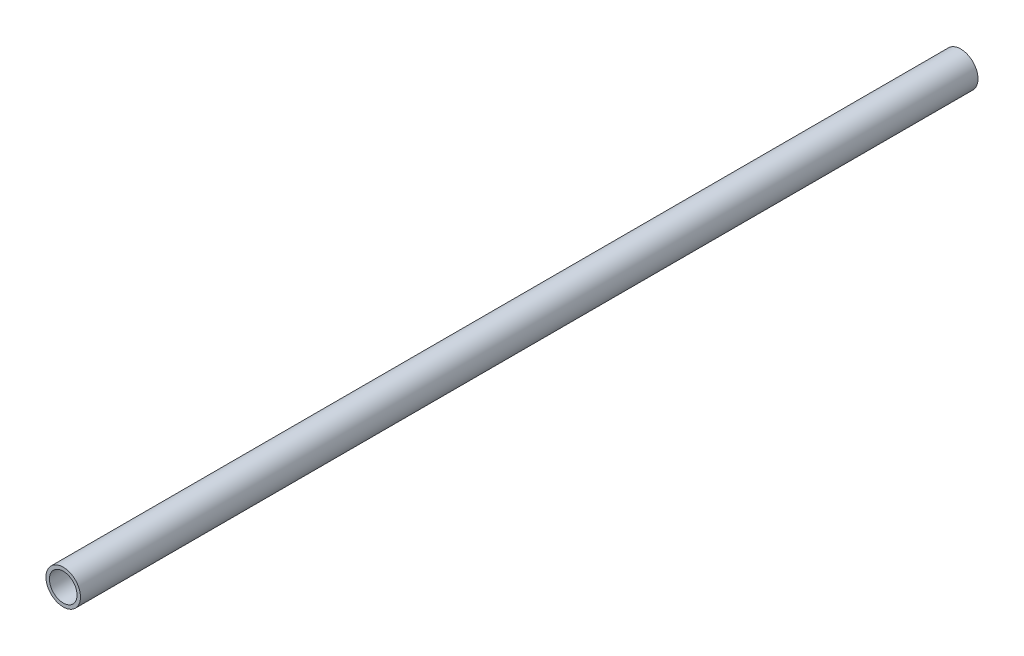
from build123d import *

# Parameters (mm, degrees)
SKETCH1_R           = 25
SKETCH1_R_2         = 20
BOSS_EXTRUDE1_DEPTH = 1300


with BuildPart() as part:
    # Sketch1 → Boss-Extrude1 (new body)
    with BuildSketch(Plane.XY):
        Circle(SKETCH1_R)
        Circle(SKETCH1_R_2, mode=Mode.SUBTRACT)
    extrude(amount=BOSS_EXTRUDE1_DEPTH)


solid = part.part
